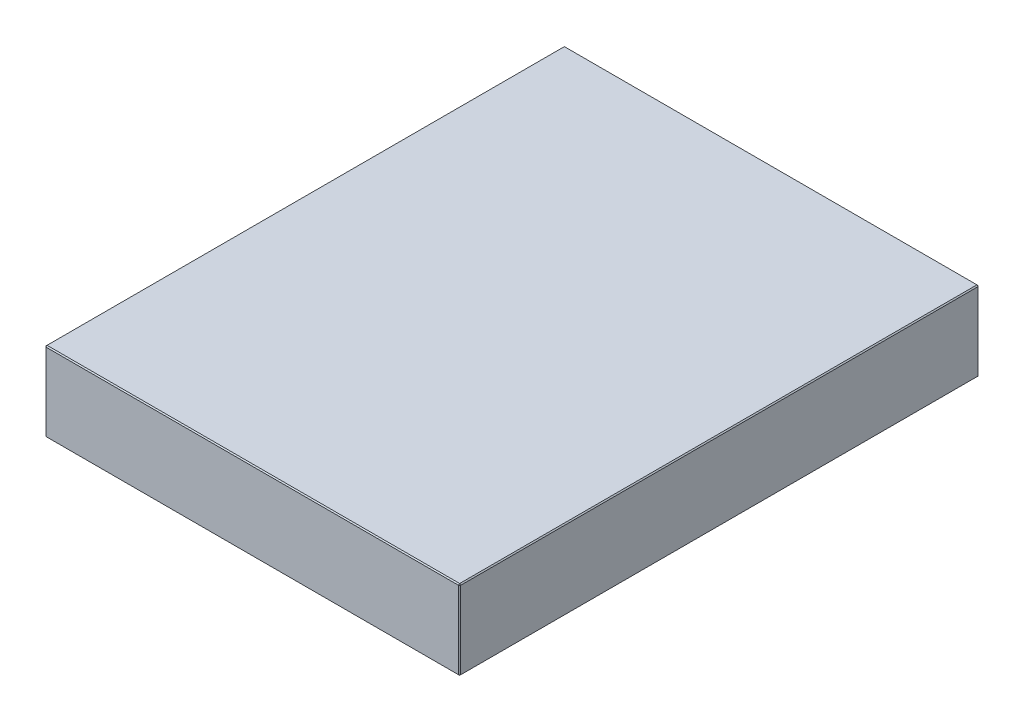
ISO-10303-21;
HEADER;
FILE_DESCRIPTION(('STEP AP214'),'2;1');
FILE_NAME('part.step','',(''),(''),'','','');
FILE_SCHEMA(('AUTOMOTIVE_DESIGN { 1 0 10303 214 1 1 1 1 }'));
ENDSEC;
DATA;
#1=APPLICATION_CONTEXT('core data for automotive mechanical design processes');
#2=APPLICATION_PROTOCOL_DEFINITION('international standard','automotive_design',2000,#1);
#3=PRODUCT_CONTEXT('',#1,'mechanical');
#4=PRODUCT('Part','Part','',(#3));
#5=PRODUCT_RELATED_PRODUCT_CATEGORY('part','',(#4));
#6=PRODUCT_DEFINITION_FORMATION('','',#4);
#7=PRODUCT_DEFINITION_CONTEXT('part definition',#1,'design');
#8=PRODUCT_DEFINITION('design','',#6,#7);
#9=PRODUCT_DEFINITION_SHAPE('','',#8);
#10=(LENGTH_UNIT() NAMED_UNIT(*) SI_UNIT(.MILLI.,.METRE.));
#11=(NAMED_UNIT(*) PLANE_ANGLE_UNIT() SI_UNIT($,.RADIAN.));
#12=(NAMED_UNIT(*) SI_UNIT($,.STERADIAN.) SOLID_ANGLE_UNIT());
#13=UNCERTAINTY_MEASURE_WITH_UNIT(LENGTH_MEASURE(1.E-05),#10,'distance_accuracy_value','');
#14=(GEOMETRIC_REPRESENTATION_CONTEXT(3) GLOBAL_UNCERTAINTY_ASSIGNED_CONTEXT((#13)) GLOBAL_UNIT_ASSIGNED_CONTEXT((#10,
#11,#12)) REPRESENTATION_CONTEXT('',''));
#15=CARTESIAN_POINT('',(0.,0.,0.));
#16=DIRECTION('',(0.,0.,1.));
#17=DIRECTION('',(1.,0.,0.));
#18=AXIS2_PLACEMENT_3D('',#15,#16,#17);
#19=CARTESIAN_POINT('',(-198.,76.,248.));
#20=DIRECTION('',(1.,0.,0.));
#21=DIRECTION('',(0.,0.,-1.));
#22=AXIS2_PLACEMENT_3D('',#19,#20,#21);
#23=PLANE('',#22);
#24=DIRECTION('',(0.,-1.,0.));
#25=VECTOR('',#24,1.);
#26=CARTESIAN_POINT('',(-198.,76.,-247.));
#27=LINE('',#26,#25);
#28=CARTESIAN_POINT('',(-198.,75.,-247.));
#29=VERTEX_POINT('',#28);
#30=CARTESIAN_POINT('',(-198.,1.00000000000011,-247.));
#31=VERTEX_POINT('',#30);
#32=EDGE_CURVE('E114',#29,#31,#27,.T.);
#33=ORIENTED_EDGE('',*,*,#32,.T.);
#34=DIRECTION('',(0.,0.,1.));
#35=VECTOR('',#34,1.);
#36=CARTESIAN_POINT('',(-198.,1.00000000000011,248.));
#37=LINE('',#36,#35);
#38=CARTESIAN_POINT('',(-198.,1.00000000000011,247.));
#39=VERTEX_POINT('',#38);
#40=EDGE_CURVE('E110',#31,#39,#37,.T.);
#41=ORIENTED_EDGE('',*,*,#40,.T.);
#42=DIRECTION('',(0.,1.,0.));
#43=VECTOR('',#42,1.);
#44=CARTESIAN_POINT('',(-198.,76.,247.));
#45=LINE('',#44,#43);
#46=CARTESIAN_POINT('',(-198.,75.,247.));
#47=VERTEX_POINT('',#46);
#48=EDGE_CURVE('E103',#39,#47,#45,.T.);
#49=ORIENTED_EDGE('',*,*,#48,.T.);
#50=DIRECTION('',(0.,0.,-1.));
#51=VECTOR('',#50,1.);
#52=CARTESIAN_POINT('',(-198.,75.,-248.));
#53=LINE('',#52,#51);
#54=EDGE_CURVE('E107',#47,#29,#53,.T.);
#55=ORIENTED_EDGE('',*,*,#54,.T.);
#56=EDGE_LOOP('',(#33,#41,#49,#55));
#57=FACE_BOUND('',#56,.T.);
#58=ADVANCED_FACE('F15',(#57),#23,.F.);
#59=CARTESIAN_POINT('',(198.,76.,248.));
#60=DIRECTION('',(0.,0.,-1.));
#61=DIRECTION('',(-1.,0.,0.));
#62=AXIS2_PLACEMENT_3D('',#59,#60,#61);
#63=PLANE('',#62);
#64=DIRECTION('',(-1.,0.,0.));
#65=VECTOR('',#64,1.);
#66=CARTESIAN_POINT('',(-198.,75.,248.));
#67=LINE('',#66,#65);
#68=CARTESIAN_POINT('',(197.,75.,248.));
#69=VERTEX_POINT('',#68);
#70=CARTESIAN_POINT('',(-197.,75.,248.));
#71=VERTEX_POINT('',#70);
#72=EDGE_CURVE('E164',#69,#71,#67,.T.);
#73=ORIENTED_EDGE('',*,*,#72,.T.);
#74=DIRECTION('',(0.,-1.,0.));
#75=VECTOR('',#74,1.);
#76=CARTESIAN_POINT('',(-197.,76.,248.));
#77=LINE('',#76,#75);
#78=CARTESIAN_POINT('',(-197.,1.00000000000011,248.));
#79=VERTEX_POINT('',#78);
#80=EDGE_CURVE('E122',#71,#79,#77,.T.);
#81=ORIENTED_EDGE('',*,*,#80,.T.);
#82=DIRECTION('',(1.,0.,0.));
#83=VECTOR('',#82,1.);
#84=CARTESIAN_POINT('',(198.,1.00000000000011,248.));
#85=LINE('',#84,#83);
#86=CARTESIAN_POINT('',(197.,1.00000000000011,248.));
#87=VERTEX_POINT('',#86);
#88=EDGE_CURVE('E168',#79,#87,#85,.T.);
#89=ORIENTED_EDGE('',*,*,#88,.T.);
#90=DIRECTION('',(0.,1.,0.));
#91=VECTOR('',#90,1.);
#92=CARTESIAN_POINT('',(197.,76.,248.));
#93=LINE('',#92,#91);
#94=EDGE_CURVE('E166',#87,#69,#93,.T.);
#95=ORIENTED_EDGE('',*,*,#94,.T.);
#96=EDGE_LOOP('',(#73,#81,#89,#95));
#97=FACE_BOUND('',#96,.T.);
#98=ADVANCED_FACE('F275',(#97),#63,.F.);
#99=CARTESIAN_POINT('',(198.,76.,248.));
#100=DIRECTION('',(-1.,0.,0.));
#101=DIRECTION('',(0.,0.,1.));
#102=AXIS2_PLACEMENT_3D('',#99,#100,#101);
#103=PLANE('',#102);
#104=DIRECTION('',(0.,0.,-1.));
#105=VECTOR('',#104,1.);
#106=CARTESIAN_POINT('',(198.,1.00000000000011,248.));
#107=LINE('',#106,#105);
#108=CARTESIAN_POINT('',(198.,1.00000000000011,247.));
#109=VERTEX_POINT('',#108);
#110=CARTESIAN_POINT('',(198.,1.00000000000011,-247.));
#111=VERTEX_POINT('',#110);
#112=EDGE_CURVE('E159',#109,#111,#107,.T.);
#113=ORIENTED_EDGE('',*,*,#112,.T.);
#114=DIRECTION('',(0.,1.,0.));
#115=VECTOR('',#114,1.);
#116=CARTESIAN_POINT('',(198.,76.,-247.));
#117=LINE('',#116,#115);
#118=CARTESIAN_POINT('',(198.,75.,-247.));
#119=VERTEX_POINT('',#118);
#120=EDGE_CURVE('E161',#111,#119,#117,.T.);
#121=ORIENTED_EDGE('',*,*,#120,.T.);
#122=DIRECTION('',(0.,0.,1.));
#123=VECTOR('',#122,1.);
#124=CARTESIAN_POINT('',(198.,75.,248.));
#125=LINE('',#124,#123);
#126=CARTESIAN_POINT('',(198.,75.,247.));
#127=VERTEX_POINT('',#126);
#128=EDGE_CURVE('E155',#119,#127,#125,.T.);
#129=ORIENTED_EDGE('',*,*,#128,.T.);
#130=DIRECTION('',(0.,-1.,0.));
#131=VECTOR('',#130,1.);
#132=CARTESIAN_POINT('',(198.,76.,247.));
#133=LINE('',#132,#131);
#134=EDGE_CURVE('E157',#127,#109,#133,.T.);
#135=ORIENTED_EDGE('',*,*,#134,.T.);
#136=EDGE_LOOP('',(#113,#121,#129,#135));
#137=FACE_BOUND('',#136,.T.);
#138=ADVANCED_FACE('F254',(#137),#103,.F.);
#139=CARTESIAN_POINT('',(198.,76.,-248.));
#140=DIRECTION('',(0.,0.,1.));
#141=DIRECTION('',(1.,0.,0.));
#142=AXIS2_PLACEMENT_3D('',#139,#140,#141);
#143=PLANE('',#142);
#144=DIRECTION('',(0.,-1.,0.));
#145=VECTOR('',#144,1.);
#146=CARTESIAN_POINT('',(197.,76.,-248.));
#147=LINE('',#146,#145);
#148=CARTESIAN_POINT('',(197.,75.,-248.));
#149=VERTEX_POINT('',#148);
#150=CARTESIAN_POINT('',(197.,1.00000000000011,-248.));
#151=VERTEX_POINT('',#150);
#152=EDGE_CURVE('E148',#149,#151,#147,.T.);
#153=ORIENTED_EDGE('',*,*,#152,.T.);
#154=DIRECTION('',(-1.,0.,0.));
#155=VECTOR('',#154,1.);
#156=CARTESIAN_POINT('',(198.,1.00000000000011,-248.));
#157=LINE('',#156,#155);
#158=CARTESIAN_POINT('',(-197.,1.00000000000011,-248.));
#159=VERTEX_POINT('',#158);
#160=EDGE_CURVE('E153',#151,#159,#157,.T.);
#161=ORIENTED_EDGE('',*,*,#160,.T.);
#162=DIRECTION('',(0.,1.,0.));
#163=VECTOR('',#162,1.);
#164=CARTESIAN_POINT('',(-197.,76.,-248.));
#165=LINE('',#164,#163);
#166=CARTESIAN_POINT('',(-197.,75.,-248.));
#167=VERTEX_POINT('',#166);
#168=EDGE_CURVE('E150',#159,#167,#165,.T.);
#169=ORIENTED_EDGE('',*,*,#168,.T.);
#170=DIRECTION('',(1.,0.,0.));
#171=VECTOR('',#170,1.);
#172=CARTESIAN_POINT('',(198.,75.,-248.));
#173=LINE('',#172,#171);
#174=EDGE_CURVE('E146',#167,#149,#173,.T.);
#175=ORIENTED_EDGE('',*,*,#174,.T.);
#176=EDGE_LOOP('',(#153,#161,#169,#175));
#177=FACE_BOUND('',#176,.T.);
#178=ADVANCED_FACE('F284',(#177),#143,.F.);
#179=CARTESIAN_POINT('',(0.,76.,0.));
#180=DIRECTION('',(0.,1.,0.));
#181=DIRECTION('',(0.,0.,1.));
#182=AXIS2_PLACEMENT_3D('',#179,#180,#181);
#183=PLANE('',#182);
#184=DIRECTION('',(0.,0.,-1.));
#185=VECTOR('',#184,1.);
#186=CARTESIAN_POINT('',(197.,76.,-248.));
#187=LINE('',#186,#185);
#188=CARTESIAN_POINT('',(197.,76.,247.));
#189=VERTEX_POINT('',#188);
#190=CARTESIAN_POINT('',(197.,76.,-247.));
#191=VERTEX_POINT('',#190);
#192=EDGE_CURVE('E24',#189,#191,#187,.T.);
#193=ORIENTED_EDGE('',*,*,#192,.T.);
#194=DIRECTION('',(-1.,0.,0.));
#195=VECTOR('',#194,1.);
#196=CARTESIAN_POINT('',(-198.,76.,-247.));
#197=LINE('',#196,#195);
#198=CARTESIAN_POINT('',(-197.,76.,-247.));
#199=VERTEX_POINT('',#198);
#200=EDGE_CURVE('E9',#191,#199,#197,.T.);
#201=ORIENTED_EDGE('',*,*,#200,.T.);
#202=DIRECTION('',(0.,0.,1.));
#203=VECTOR('',#202,1.);
#204=CARTESIAN_POINT('',(-197.,76.,248.));
#205=LINE('',#204,#203);
#206=CARTESIAN_POINT('',(-197.,76.,247.));
#207=VERTEX_POINT('',#206);
#208=EDGE_CURVE('E180',#199,#207,#205,.T.);
#209=ORIENTED_EDGE('',*,*,#208,.T.);
#210=DIRECTION('',(1.,0.,0.));
#211=VECTOR('',#210,1.);
#212=CARTESIAN_POINT('',(198.,76.,247.));
#213=LINE('',#212,#211);
#214=EDGE_CURVE('E35',#207,#189,#213,.T.);
#215=ORIENTED_EDGE('',*,*,#214,.T.);
#216=EDGE_LOOP('',(#193,#201,#209,#215));
#217=FACE_BOUND('',#216,.T.);
#218=ADVANCED_FACE('F350',(#217),#183,.T.);
#219=CARTESIAN_POINT('',(0.,0.,0.));
#220=DIRECTION('',(0.,1.,0.));
#221=DIRECTION('',(0.,0.,1.));
#222=AXIS2_PLACEMENT_3D('',#219,#220,#221);
#223=PLANE('',#222);
#224=DIRECTION('',(0.,0.,1.));
#225=VECTOR('',#224,1.);
#226=CARTESIAN_POINT('',(197.,0.,0.));
#227=LINE('',#226,#225);
#228=CARTESIAN_POINT('',(197.,0.,-247.));
#229=VERTEX_POINT('',#228);
#230=CARTESIAN_POINT('',(197.,0.,247.));
#231=VERTEX_POINT('',#230);
#232=EDGE_CURVE('E171',#229,#231,#227,.T.);
#233=ORIENTED_EDGE('',*,*,#232,.T.);
#234=DIRECTION('',(-1.,0.,0.));
#235=VECTOR('',#234,1.);
#236=CARTESIAN_POINT('',(0.,0.,247.));
#237=LINE('',#236,#235);
#238=CARTESIAN_POINT('',(-197.,0.,247.));
#239=VERTEX_POINT('',#238);
#240=EDGE_CURVE('E177',#231,#239,#237,.T.);
#241=ORIENTED_EDGE('',*,*,#240,.T.);
#242=DIRECTION('',(0.,0.,-1.));
#243=VECTOR('',#242,1.);
#244=CARTESIAN_POINT('',(-197.,0.,0.));
#245=LINE('',#244,#243);
#246=CARTESIAN_POINT('',(-197.,0.,-247.));
#247=VERTEX_POINT('',#246);
#248=EDGE_CURVE('E175',#239,#247,#245,.T.);
#249=ORIENTED_EDGE('',*,*,#248,.T.);
#250=DIRECTION('',(1.,0.,0.));
#251=VECTOR('',#250,1.);
#252=CARTESIAN_POINT('',(0.,0.,-247.));
#253=LINE('',#252,#251);
#254=EDGE_CURVE('E173',#247,#229,#253,.T.);
#255=ORIENTED_EDGE('',*,*,#254,.T.);
#256=EDGE_LOOP('',(#233,#241,#249,#255));
#257=FACE_BOUND('',#256,.T.);
#258=ADVANCED_FACE('F246',(#257),#223,.F.);
#259=CARTESIAN_POINT('',(198.,76.,247.));
#260=DIRECTION('',(-0.707106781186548,0.,-0.707106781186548));
#261=DIRECTION('',(0.,-1.,0.));
#262=AXIS2_PLACEMENT_3D('',#259,#260,#261);
#263=PLANE('',#262);
#264=DIRECTION('',(-0.707106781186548,0.,0.707106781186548));
#265=VECTOR('',#264,1.);
#266=CARTESIAN_POINT('',(197.,75.,248.));
#267=LINE('',#266,#265);
#268=EDGE_CURVE('E19',#69,#127,#267,.F.);
#269=ORIENTED_EDGE('',*,*,#268,.F.);
#270=ORIENTED_EDGE('',*,*,#94,.F.);
#271=DIRECTION('',(0.707106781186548,0.,-0.707106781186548));
#272=VECTOR('',#271,1.);
#273=CARTESIAN_POINT('',(197.,1.00000000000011,248.));
#274=LINE('',#273,#272);
#275=EDGE_CURVE('E142',#109,#87,#274,.F.);
#276=ORIENTED_EDGE('',*,*,#275,.F.);
#277=ORIENTED_EDGE('',*,*,#134,.F.);
#278=EDGE_LOOP('',(#269,#270,#276,#277));
#279=FACE_BOUND('',#278,.T.);
#280=ADVANCED_FACE('F17',(#279),#263,.F.);
#281=CARTESIAN_POINT('',(197.,75.,248.));
#282=DIRECTION('',(0.577350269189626,0.577350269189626,0.577350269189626));
#283=DIRECTION('',(0.707106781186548,0.,-0.707106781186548));
#284=AXIS2_PLACEMENT_3D('',#281,#282,#283);
#285=PLANE('',#284);
#286=DIRECTION('',(0.,-0.707106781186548,0.707106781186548));
#287=VECTOR('',#286,1.);
#288=CARTESIAN_POINT('',(197.,75.,248.));
#289=LINE('',#288,#287);
#290=EDGE_CURVE('E226',#69,#189,#289,.F.);
#291=ORIENTED_EDGE('',*,*,#290,.F.);
#292=ORIENTED_EDGE('',*,*,#268,.T.);
#293=DIRECTION('',(-0.707106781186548,0.707106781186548,0.));
#294=VECTOR('',#293,1.);
#295=CARTESIAN_POINT('',(197.5,75.5,247.));
#296=LINE('',#295,#294);
#297=EDGE_CURVE('E228',#189,#127,#296,.F.);
#298=ORIENTED_EDGE('',*,*,#297,.F.);
#299=EDGE_LOOP('',(#291,#292,#298));
#300=FACE_BOUND('',#299,.T.);
#301=ADVANCED_FACE('F270',(#300),#285,.T.);
#302=CARTESIAN_POINT('',(197.,1.00000000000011,248.));
#303=DIRECTION('',(0.577350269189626,-0.577350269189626,0.577350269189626));
#304=DIRECTION('',(0.707106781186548,0.,-0.707106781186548));
#305=AXIS2_PLACEMENT_3D('',#302,#303,#304);
#306=PLANE('',#305);
#307=DIRECTION('',(-0.707106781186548,-0.707106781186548,0.));
#308=VECTOR('',#307,1.);
#309=CARTESIAN_POINT('',(197.5,0.500000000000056,247.));
#310=LINE('',#309,#308);
#311=EDGE_CURVE('E220',#109,#231,#310,.T.);
#312=ORIENTED_EDGE('',*,*,#311,.F.);
#313=ORIENTED_EDGE('',*,*,#275,.T.);
#314=DIRECTION('',(0.,0.707106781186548,0.707106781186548));
#315=VECTOR('',#314,1.);
#316=CARTESIAN_POINT('',(197.,1.00000000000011,248.));
#317=LINE('',#316,#315);
#318=EDGE_CURVE('E223',#231,#87,#317,.T.);
#319=ORIENTED_EDGE('',*,*,#318,.F.);
#320=EDGE_LOOP('',(#312,#313,#319));
#321=FACE_BOUND('',#320,.T.);
#322=ADVANCED_FACE('F235',(#321),#306,.T.);
#323=CARTESIAN_POINT('',(197.,76.,0.));
#324=DIRECTION('',(0.707106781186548,0.707106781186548,0.));
#325=DIRECTION('',(0.,0.,1.));
#326=AXIS2_PLACEMENT_3D('',#323,#324,#325);
#327=PLANE('',#326);
#328=ORIENTED_EDGE('',*,*,#297,.T.);
#329=ORIENTED_EDGE('',*,*,#128,.F.);
#330=DIRECTION('',(0.707106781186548,-0.707106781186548,0.));
#331=VECTOR('',#330,1.);
#332=CARTESIAN_POINT('',(198.,75.,-247.));
#333=LINE('',#332,#331);
#334=EDGE_CURVE('E215',#191,#119,#333,.T.);
#335=ORIENTED_EDGE('',*,*,#334,.F.);
#336=ORIENTED_EDGE('',*,*,#192,.F.);
#337=EDGE_LOOP('',(#328,#329,#335,#336));
#338=FACE_BOUND('',#337,.T.);
#339=ADVANCED_FACE('F265',(#338),#327,.T.);
#340=CARTESIAN_POINT('',(0.,76.,247.));
#341=DIRECTION('',(0.,0.707106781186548,0.707106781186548));
#342=DIRECTION('',(-1.,0.,0.));
#343=AXIS2_PLACEMENT_3D('',#340,#341,#342);
#344=PLANE('',#343);
#345=ORIENTED_EDGE('',*,*,#290,.T.);
#346=ORIENTED_EDGE('',*,*,#214,.F.);
#347=DIRECTION('',(0.,0.707106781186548,-0.707106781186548));
#348=VECTOR('',#347,1.);
#349=CARTESIAN_POINT('',(-197.,75.5,247.5));
#350=LINE('',#349,#348);
#351=EDGE_CURVE('E126',#71,#207,#350,.T.);
#352=ORIENTED_EDGE('',*,*,#351,.F.);
#353=ORIENTED_EDGE('',*,*,#72,.F.);
#354=EDGE_LOOP('',(#345,#346,#352,#353));
#355=FACE_BOUND('',#354,.T.);
#356=ADVANCED_FACE('F273',(#355),#344,.T.);
#357=CARTESIAN_POINT('',(-197.,76.,248.));
#358=DIRECTION('',(0.707106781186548,0.,-0.707106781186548));
#359=DIRECTION('',(0.,-1.,0.));
#360=AXIS2_PLACEMENT_3D('',#357,#358,#359);
#361=PLANE('',#360);
#362=DIRECTION('',(0.707106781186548,0.,0.707106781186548));
#363=VECTOR('',#362,1.);
#364=CARTESIAN_POINT('',(-197.,1.00000000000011,248.));
#365=LINE('',#364,#363);
#366=EDGE_CURVE('E127',#79,#39,#365,.F.);
#367=ORIENTED_EDGE('',*,*,#366,.F.);
#368=ORIENTED_EDGE('',*,*,#80,.F.);
#369=DIRECTION('',(-0.707106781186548,0.,-0.707106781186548));
#370=VECTOR('',#369,1.);
#371=CARTESIAN_POINT('',(-198.,75.,247.));
#372=LINE('',#371,#370);
#373=EDGE_CURVE('E118',#47,#71,#372,.F.);
#374=ORIENTED_EDGE('',*,*,#373,.F.);
#375=ORIENTED_EDGE('',*,*,#48,.F.);
#376=EDGE_LOOP('',(#367,#368,#374,#375));
#377=FACE_BOUND('',#376,.T.);
#378=ADVANCED_FACE('F120',(#377),#361,.F.);
#379=CARTESIAN_POINT('',(198.,1.00000000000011,248.));
#380=DIRECTION('',(0.,0.707106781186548,-0.707106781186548));
#381=DIRECTION('',(1.,0.,0.));
#382=AXIS2_PLACEMENT_3D('',#379,#380,#381);
#383=PLANE('',#382);
#384=ORIENTED_EDGE('',*,*,#318,.T.);
#385=ORIENTED_EDGE('',*,*,#88,.F.);
#386=DIRECTION('',(0.,-0.707106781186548,-0.707106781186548));
#387=VECTOR('',#386,1.);
#388=CARTESIAN_POINT('',(-197.,1.00000000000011,248.));
#389=LINE('',#388,#387);
#390=EDGE_CURVE('E211',#239,#79,#389,.F.);
#391=ORIENTED_EDGE('',*,*,#390,.F.);
#392=ORIENTED_EDGE('',*,*,#240,.F.);
#393=EDGE_LOOP('',(#384,#385,#391,#392));
#394=FACE_BOUND('',#393,.T.);
#395=ADVANCED_FACE('F243',(#394),#383,.F.);
#396=CARTESIAN_POINT('',(198.,1.00000000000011,248.));
#397=DIRECTION('',(-0.707106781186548,0.707106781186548,0.));
#398=DIRECTION('',(0.,0.,-1.));
#399=AXIS2_PLACEMENT_3D('',#396,#397,#398);
#400=PLANE('',#399);
#401=ORIENTED_EDGE('',*,*,#311,.T.);
#402=ORIENTED_EDGE('',*,*,#232,.F.);
#403=DIRECTION('',(0.707106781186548,0.707106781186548,0.));
#404=VECTOR('',#403,1.);
#405=CARTESIAN_POINT('',(197.5,0.50000000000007,-247.));
#406=LINE('',#405,#404);
#407=EDGE_CURVE('E208',#111,#229,#406,.F.);
#408=ORIENTED_EDGE('',*,*,#407,.F.);
#409=ORIENTED_EDGE('',*,*,#112,.F.);
#410=EDGE_LOOP('',(#401,#402,#408,#409));
#411=FACE_BOUND('',#410,.T.);
#412=ADVANCED_FACE('F251',(#411),#400,.F.);
#413=CARTESIAN_POINT('',(197.,76.,-248.));
#414=DIRECTION('',(-0.707106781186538,0.,0.707106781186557));
#415=DIRECTION('',(0.,-1.,0.));
#416=AXIS2_PLACEMENT_3D('',#413,#414,#415);
#417=PLANE('',#416);
#418=DIRECTION('',(0.707106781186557,0.,0.707106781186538));
#419=VECTOR('',#418,1.);
#420=CARTESIAN_POINT('',(198.,75.,-247.));
#421=LINE('',#420,#419);
#422=EDGE_CURVE('E217',#119,#149,#421,.F.);
#423=ORIENTED_EDGE('',*,*,#422,.F.);
#424=ORIENTED_EDGE('',*,*,#120,.F.);
#425=DIRECTION('',(-0.707106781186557,0.,-0.707106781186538));
#426=VECTOR('',#425,1.);
#427=CARTESIAN_POINT('',(197.,1.00000000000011,-248.));
#428=LINE('',#427,#426);
#429=EDGE_CURVE('E205',#151,#111,#428,.F.);
#430=ORIENTED_EDGE('',*,*,#429,.F.);
#431=ORIENTED_EDGE('',*,*,#152,.F.);
#432=EDGE_LOOP('',(#423,#424,#430,#431));
#433=FACE_BOUND('',#432,.T.);
#434=ADVANCED_FACE('F258',(#433),#417,.F.);
#435=CARTESIAN_POINT('',(198.,75.,-247.));
#436=DIRECTION('',(0.577350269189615,0.577350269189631,-0.577350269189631));
#437=DIRECTION('',(0.,0.707106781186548,0.707106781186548));
#438=AXIS2_PLACEMENT_3D('',#435,#436,#437);
#439=PLANE('',#438);
#440=ORIENTED_EDGE('',*,*,#334,.T.);
#441=ORIENTED_EDGE('',*,*,#422,.T.);
#442=DIRECTION('',(0.,0.707106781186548,0.707106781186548));
#443=VECTOR('',#442,1.);
#444=CARTESIAN_POINT('',(197.,75.5,-247.5));
#445=LINE('',#444,#443);
#446=EDGE_CURVE('E134',#191,#149,#445,.F.);
#447=ORIENTED_EDGE('',*,*,#446,.F.);
#448=EDGE_LOOP('',(#440,#441,#447));
#449=FACE_BOUND('',#448,.T.);
#450=ADVANCED_FACE('F325',(#449),#439,.T.);
#451=CARTESIAN_POINT('',(-198.,75.,247.));
#452=DIRECTION('',(-0.577350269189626,0.577350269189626,0.577350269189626));
#453=DIRECTION('',(0.707106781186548,0.,0.707106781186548));
#454=AXIS2_PLACEMENT_3D('',#451,#452,#453);
#455=PLANE('',#454);
#456=ORIENTED_EDGE('',*,*,#373,.T.);
#457=ORIENTED_EDGE('',*,*,#351,.T.);
#458=DIRECTION('',(-0.707106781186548,-0.707106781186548,0.));
#459=VECTOR('',#458,1.);
#460=CARTESIAN_POINT('',(-198.,75.,247.));
#461=LINE('',#460,#459);
#462=EDGE_CURVE('E130',#47,#207,#461,.F.);
#463=ORIENTED_EDGE('',*,*,#462,.F.);
#464=EDGE_LOOP('',(#456,#457,#463));
#465=FACE_BOUND('',#464,.T.);
#466=ADVANCED_FACE('F131',(#465),#455,.T.);
#467=CARTESIAN_POINT('',(-197.,1.00000000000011,248.));
#468=DIRECTION('',(-0.577350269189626,-0.577350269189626,0.577350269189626));
#469=DIRECTION('',(0.707106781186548,0.,0.707106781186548));
#470=AXIS2_PLACEMENT_3D('',#467,#468,#469);
#471=PLANE('',#470);
#472=ORIENTED_EDGE('',*,*,#390,.T.);
#473=ORIENTED_EDGE('',*,*,#366,.T.);
#474=DIRECTION('',(-0.707106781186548,0.707106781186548,0.));
#475=VECTOR('',#474,1.);
#476=CARTESIAN_POINT('',(-197.5,0.500000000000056,247.));
#477=LINE('',#476,#475);
#478=EDGE_CURVE('E135',#239,#39,#477,.T.);
#479=ORIENTED_EDGE('',*,*,#478,.F.);
#480=EDGE_LOOP('',(#472,#473,#479));
#481=FACE_BOUND('',#480,.T.);
#482=ADVANCED_FACE('F318',(#481),#471,.T.);
#483=CARTESIAN_POINT('',(197.,1.00000000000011,-248.));
#484=DIRECTION('',(0.577350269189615,-0.577350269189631,-0.577350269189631));
#485=DIRECTION('',(0.,0.707106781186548,-0.707106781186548));
#486=AXIS2_PLACEMENT_3D('',#483,#484,#485);
#487=PLANE('',#486);
#488=ORIENTED_EDGE('',*,*,#429,.T.);
#489=ORIENTED_EDGE('',*,*,#407,.T.);
#490=DIRECTION('',(0.,-0.707106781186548,0.707106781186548));
#491=VECTOR('',#490,1.);
#492=CARTESIAN_POINT('',(197.,1.00000000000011,-248.));
#493=LINE('',#492,#491);
#494=EDGE_CURVE('E198',#151,#229,#493,.T.);
#495=ORIENTED_EDGE('',*,*,#494,.F.);
#496=EDGE_LOOP('',(#488,#489,#495));
#497=FACE_BOUND('',#496,.T.);
#498=ADVANCED_FACE('F314',(#497),#487,.T.);
#499=CARTESIAN_POINT('',(0.,76.,-247.));
#500=DIRECTION('',(0.,0.707106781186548,-0.707106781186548));
#501=DIRECTION('',(1.,0.,0.));
#502=AXIS2_PLACEMENT_3D('',#499,#500,#501);
#503=PLANE('',#502);
#504=ORIENTED_EDGE('',*,*,#446,.T.);
#505=ORIENTED_EDGE('',*,*,#174,.F.);
#506=DIRECTION('',(0.,-0.707106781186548,-0.707106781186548));
#507=VECTOR('',#506,1.);
#508=CARTESIAN_POINT('',(-197.,75.,-248.));
#509=LINE('',#508,#507);
#510=EDGE_CURVE('E195',#199,#167,#509,.T.);
#511=ORIENTED_EDGE('',*,*,#510,.F.);
#512=ORIENTED_EDGE('',*,*,#200,.F.);
#513=EDGE_LOOP('',(#504,#505,#511,#512));
#514=FACE_BOUND('',#513,.T.);
#515=ADVANCED_FACE('F311',(#514),#503,.T.);
#516=CARTESIAN_POINT('',(-197.,76.,0.));
#517=DIRECTION('',(-0.707106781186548,0.707106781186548,0.));
#518=DIRECTION('',(0.,0.,-1.));
#519=AXIS2_PLACEMENT_3D('',#516,#517,#518);
#520=PLANE('',#519);
#521=ORIENTED_EDGE('',*,*,#462,.T.);
#522=ORIENTED_EDGE('',*,*,#208,.F.);
#523=DIRECTION('',(0.707106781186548,0.707106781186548,0.));
#524=VECTOR('',#523,1.);
#525=CARTESIAN_POINT('',(-197.5,75.5,-247.));
#526=LINE('',#525,#524);
#527=EDGE_CURVE('E138',#29,#199,#526,.T.);
#528=ORIENTED_EDGE('',*,*,#527,.F.);
#529=ORIENTED_EDGE('',*,*,#54,.F.);
#530=EDGE_LOOP('',(#521,#522,#528,#529));
#531=FACE_BOUND('',#530,.T.);
#532=ADVANCED_FACE('F137',(#531),#520,.T.);
#533=CARTESIAN_POINT('',(-198.,1.00000000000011,248.));
#534=DIRECTION('',(0.707106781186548,0.707106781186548,0.));
#535=DIRECTION('',(0.,0.,1.));
#536=AXIS2_PLACEMENT_3D('',#533,#534,#535);
#537=PLANE('',#536);
#538=ORIENTED_EDGE('',*,*,#478,.T.);
#539=ORIENTED_EDGE('',*,*,#40,.F.);
#540=DIRECTION('',(0.707106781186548,-0.707106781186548,0.));
#541=VECTOR('',#540,1.);
#542=CARTESIAN_POINT('',(-198.,1.00000000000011,-247.));
#543=LINE('',#542,#541);
#544=EDGE_CURVE('E191',#247,#31,#543,.F.);
#545=ORIENTED_EDGE('',*,*,#544,.F.);
#546=ORIENTED_EDGE('',*,*,#248,.F.);
#547=EDGE_LOOP('',(#538,#539,#545,#546));
#548=FACE_BOUND('',#547,.T.);
#549=ADVANCED_FACE('F304',(#548),#537,.F.);
#550=CARTESIAN_POINT('',(198.,1.00000000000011,-248.));
#551=DIRECTION('',(0.,0.707106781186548,0.707106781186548));
#552=DIRECTION('',(-1.,0.,0.));
#553=AXIS2_PLACEMENT_3D('',#550,#551,#552);
#554=PLANE('',#553);
#555=ORIENTED_EDGE('',*,*,#494,.T.);
#556=ORIENTED_EDGE('',*,*,#254,.F.);
#557=DIRECTION('',(0.,0.707106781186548,-0.707106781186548));
#558=VECTOR('',#557,1.);
#559=CARTESIAN_POINT('',(-197.,0.500000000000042,-247.5));
#560=LINE('',#559,#558);
#561=EDGE_CURVE('E188',#159,#247,#560,.F.);
#562=ORIENTED_EDGE('',*,*,#561,.F.);
#563=ORIENTED_EDGE('',*,*,#160,.F.);
#564=EDGE_LOOP('',(#555,#556,#562,#563));
#565=FACE_BOUND('',#564,.T.);
#566=ADVANCED_FACE('F300',(#565),#554,.F.);
#567=CARTESIAN_POINT('',(-197.,75.,-248.));
#568=DIRECTION('',(-0.577350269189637,0.577350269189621,-0.577350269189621));
#569=DIRECTION('',(-0.707106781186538,0.,0.707106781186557));
#570=AXIS2_PLACEMENT_3D('',#567,#568,#569);
#571=PLANE('',#570);
#572=ORIENTED_EDGE('',*,*,#527,.T.);
#573=ORIENTED_EDGE('',*,*,#510,.T.);
#574=DIRECTION('',(0.707106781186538,0.,-0.707106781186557));
#575=VECTOR('',#574,1.);
#576=CARTESIAN_POINT('',(-197.,75.,-248.));
#577=LINE('',#576,#575);
#578=EDGE_CURVE('E186',#29,#167,#577,.T.);
#579=ORIENTED_EDGE('',*,*,#578,.F.);
#580=EDGE_LOOP('',(#572,#573,#579));
#581=FACE_BOUND('',#580,.T.);
#582=ADVANCED_FACE('F296',(#581),#571,.T.);
#583=CARTESIAN_POINT('',(-198.,1.00000000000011,-247.));
#584=DIRECTION('',(-0.577350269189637,-0.577350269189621,-0.577350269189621));
#585=DIRECTION('',(-0.707106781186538,0.,0.707106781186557));
#586=AXIS2_PLACEMENT_3D('',#583,#584,#585);
#587=PLANE('',#586);
#588=ORIENTED_EDGE('',*,*,#561,.T.);
#589=ORIENTED_EDGE('',*,*,#544,.T.);
#590=DIRECTION('',(-0.707106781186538,0.,0.707106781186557));
#591=VECTOR('',#590,1.);
#592=CARTESIAN_POINT('',(-198.,1.00000000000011,-247.));
#593=LINE('',#592,#591);
#594=EDGE_CURVE('E184',#159,#31,#593,.T.);
#595=ORIENTED_EDGE('',*,*,#594,.F.);
#596=EDGE_LOOP('',(#588,#589,#595));
#597=FACE_BOUND('',#596,.T.);
#598=ADVANCED_FACE('F292',(#597),#587,.T.);
#599=CARTESIAN_POINT('',(-198.,76.,-247.));
#600=DIRECTION('',(0.707106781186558,0.,0.707106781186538));
#601=DIRECTION('',(0.,-1.,0.));
#602=AXIS2_PLACEMENT_3D('',#599,#600,#601);
#603=PLANE('',#602);
#604=ORIENTED_EDGE('',*,*,#578,.T.);
#605=ORIENTED_EDGE('',*,*,#168,.F.);
#606=ORIENTED_EDGE('',*,*,#594,.T.);
#607=ORIENTED_EDGE('',*,*,#32,.F.);
#608=EDGE_LOOP('',(#604,#605,#606,#607));
#609=FACE_BOUND('',#608,.T.);
#610=ADVANCED_FACE('F289',(#609),#603,.F.);
#611=CLOSED_SHELL('',(#58,#98,#138,#178,#218,#258,#280,#301,#322,#339,#356,#378,#395,#412,#434,
#450,#466,#482,#498,#515,#532,#549,#566,#582,#598,#610));
#612=MANIFOLD_SOLID_BREP('B1',#611);
#613=ADVANCED_BREP_SHAPE_REPRESENTATION('',(#18,#612),#14);
#614=SHAPE_DEFINITION_REPRESENTATION(#9,#613);
ENDSEC;
END-ISO-10303-21;
